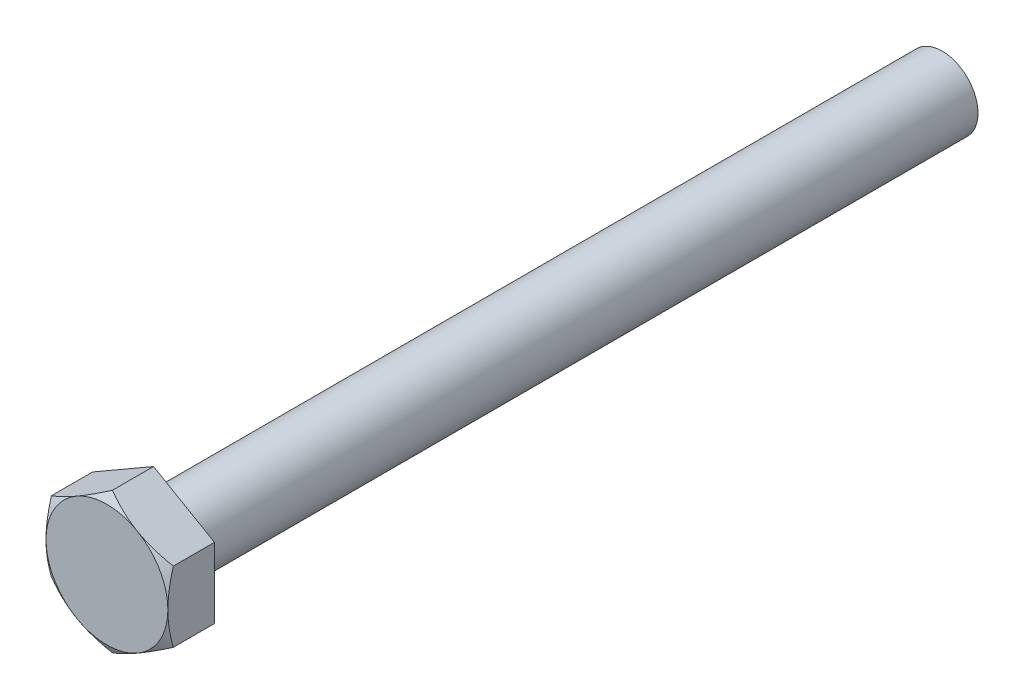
from build123d import *

# Parameters (mm, degrees)
SKETCH1_R           = 10
BOSS_EXTRUDE1_DEPTH = 110
BOSS_EXTRUDE2_DEPTH = 13
SKETCH4_OUTSIDE_W   = 899.34
SKETCH4_OUTSIDE_H   = 904.6
SKETCH4_OUTSIDE_R   = 17
CUT_EXTRUDE6_DEPTH  = 235.442601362
CUT_EXTRUDE6_DRAFT  = -60


with BuildPart() as part:
    # Sketch1 → Boss-Extrude1 (new, symmetric)
    with BuildSketch(Plane.XY):
        Circle(SKETCH1_R)
    extrude(amount=BOSS_EXTRUDE1_DEPTH, both=True)

    # Sketch3 → Boss-Extrude2 (add)
    with BuildSketch(Plane.XY.offset(110)):
        Polygon((17, -9.814954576), (17, 9.814954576), (0, 19.629909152), (-17, 9.814954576), (-17, -9.814954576), (0, -19.629909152), align=None)
    extrude(amount=BOSS_EXTRUDE2_DEPTH)


with BuildPart() as cut_extrude6_tool:
    # Sketch4 outside → Cut-Extrude6 (with draft: the straight prism first)
    with BuildSketch(Plane.XY.offset(123)):
        Rectangle(SKETCH4_OUTSIDE_W, SKETCH4_OUTSIDE_H)
        Circle(SKETCH4_OUTSIDE_R, mode=Mode.SUBTRACT)
    extrude(amount=-CUT_EXTRUDE6_DEPTH)
    # Cut-Extrude6: the draft: its side faces are tilted about the plane it starts from
    cut_extrude6_sides = [cut_extrude6_tool.faces().sort_by_distance(p)[0] for p in [
        (0, -452.3, 5.278699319),
        (449.67, 0, 5.278699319),
        (0, 452.3, 5.278699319),
        (-449.67, 0, 5.278699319),
        (-17, 0, 5.278699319),
    ]]
    draft(cut_extrude6_sides, Plane.XY.offset(123), CUT_EXTRUDE6_DRAFT)


with BuildPart() as part_1:
    add(part.part)

    # Cut-Extrude6: cut by cut_extrude6_tool
    add(cut_extrude6_tool.part, mode=Mode.SUBTRACT)


solid = part_1.part
